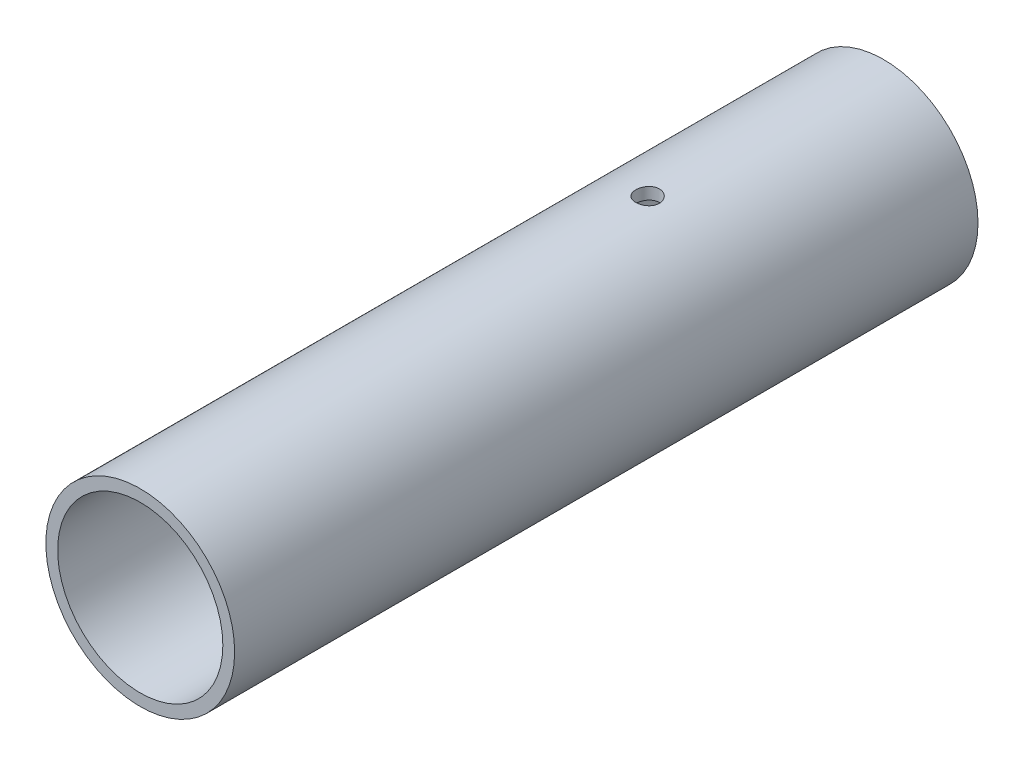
from build123d import *

# Parameters (mm, degrees)
ESQUISSE1_R             = 8
ESQUISSE1_R_2           = 7
BASE_EXTRU_MINCE_DEPTH  = 63
ESQUISSE2_R             = 1
ENL_V_MAT_EXTRU_1_DEPTH = 20


with BuildPart() as part:
    # Esquisse1 → Base-Extru.-Mince (new body)
    with BuildSketch(Plane.XY):
        Circle(ESQUISSE1_R)
        Circle(ESQUISSE1_R_2, mode=Mode.SUBTRACT)
    extrude(amount=BASE_EXTRU_MINCE_DEPTH)

    # Esquisse2 → Enl_v. mat.-Extru.1 (cut, symmetric)
    with BuildSketch(Plane(origin=(0, 0, 0), x_dir=(1, 0, 0), z_dir=(0, 1, 0))):
        with Locations(Location((0, -20, 0), (0, 0, 270))):
            Circle(ESQUISSE2_R)
    extrude(amount=ENL_V_MAT_EXTRU_1_DEPTH, both=True, mode=Mode.SUBTRACT)


solid = part.part
